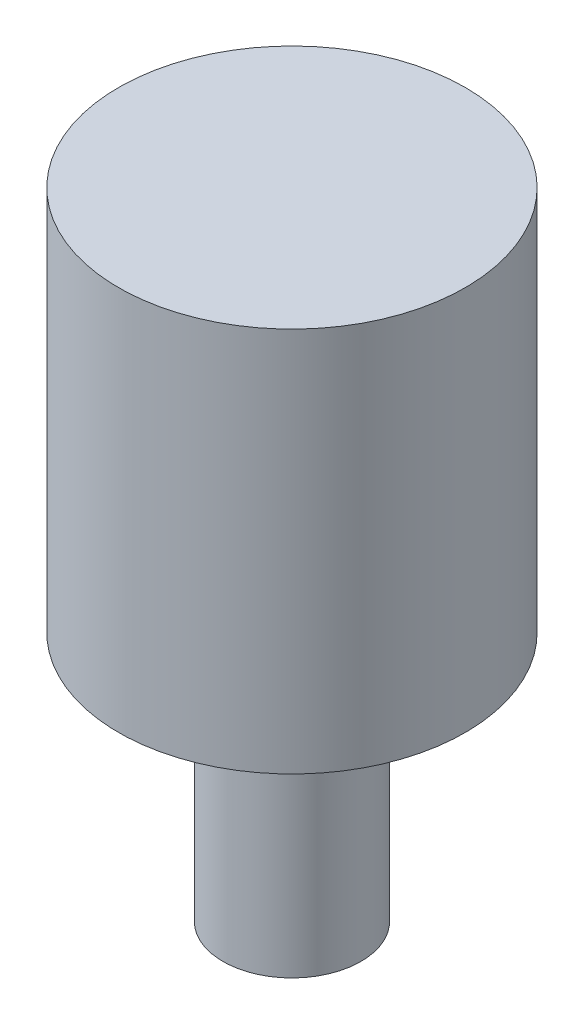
from build123d import *


with BuildPart() as part:
    # Sketch1 → Revolve1 (revolve)
    with BuildSketch(Plane.XY, mode=Mode.PRIVATE) as revolve1_sk:
        Polygon((0, 13.096875), (3.571875, 13.096875), (3.571875, 5.159375), (1.4224, 5.159375), (1.4224, 0), (0, 0), align=None)
    revolve(revolve1_sk.sketch.rotate(Axis((0, 0, 0), (0, 1, 0)), 90), axis=Axis((0, 0, 0), (0, 1, 0)))


solid = part.part
